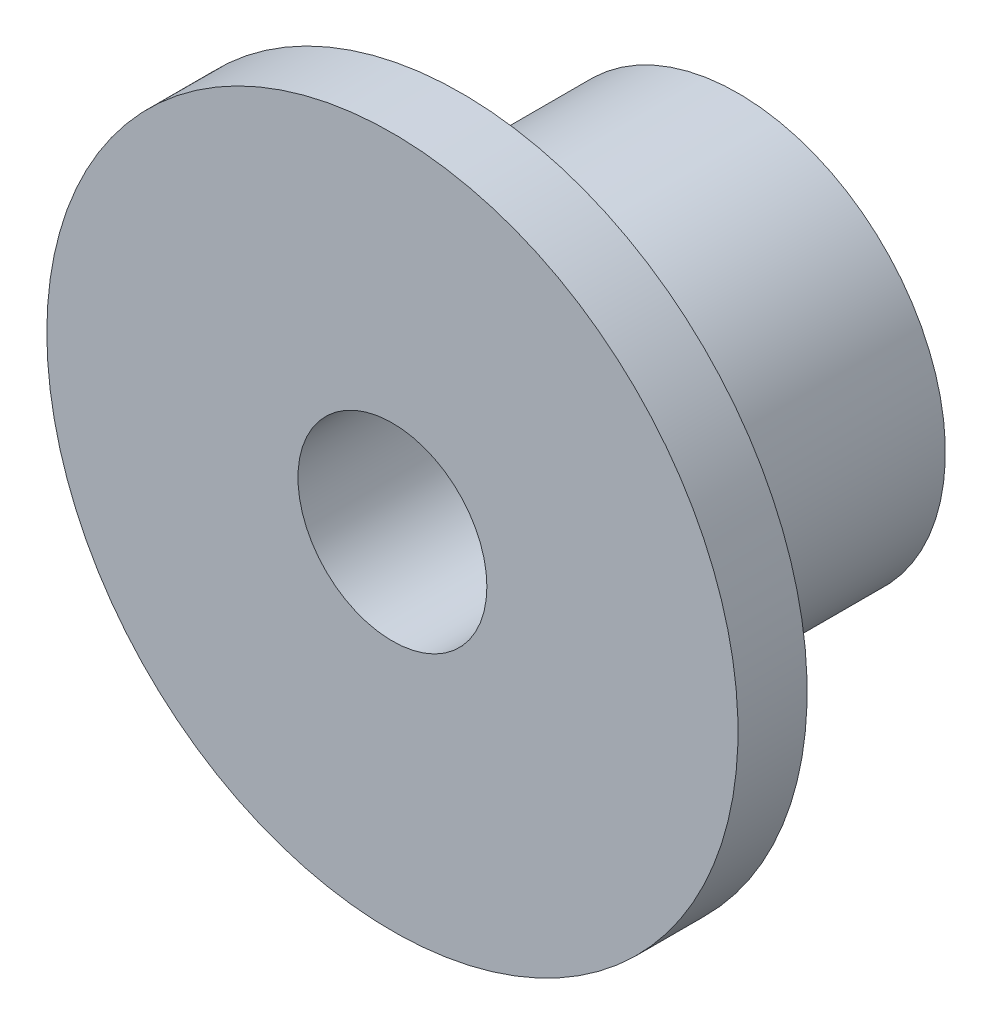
ISO-10303-21;
HEADER;
FILE_DESCRIPTION(('STEP AP214'),'2;1');
FILE_NAME('part.step','',(''),(''),'','','');
FILE_SCHEMA(('AUTOMOTIVE_DESIGN { 1 0 10303 214 1 1 1 1 }'));
ENDSEC;
DATA;
#1=APPLICATION_CONTEXT('core data for automotive mechanical design processes');
#2=APPLICATION_PROTOCOL_DEFINITION('international standard','automotive_design',2000,#1);
#3=PRODUCT_CONTEXT('',#1,'mechanical');
#4=PRODUCT('Part','Part','',(#3));
#5=PRODUCT_RELATED_PRODUCT_CATEGORY('part','',(#4));
#6=PRODUCT_DEFINITION_FORMATION('','',#4);
#7=PRODUCT_DEFINITION_CONTEXT('part definition',#1,'design');
#8=PRODUCT_DEFINITION('design','',#6,#7);
#9=PRODUCT_DEFINITION_SHAPE('','',#8);
#10=(LENGTH_UNIT() NAMED_UNIT(*) SI_UNIT(.MILLI.,.METRE.));
#11=(NAMED_UNIT(*) PLANE_ANGLE_UNIT() SI_UNIT($,.RADIAN.));
#12=(NAMED_UNIT(*) SI_UNIT($,.STERADIAN.) SOLID_ANGLE_UNIT());
#13=UNCERTAINTY_MEASURE_WITH_UNIT(LENGTH_MEASURE(1.E-05),#10,'distance_accuracy_value','');
#14=(GEOMETRIC_REPRESENTATION_CONTEXT(3) GLOBAL_UNCERTAINTY_ASSIGNED_CONTEXT((#13)) GLOBAL_UNIT_ASSIGNED_CONTEXT((#10,
#11,#12)) REPRESENTATION_CONTEXT('',''));
#15=CARTESIAN_POINT('',(0.,0.,0.));
#16=DIRECTION('',(0.,0.,1.));
#17=DIRECTION('',(1.,0.,0.));
#18=AXIS2_PLACEMENT_3D('',#15,#16,#17);
#19=CARTESIAN_POINT('',(-2.707236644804,4.523108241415,-3.9));
#20=DIRECTION('',(0.,0.,-1.));
#21=DIRECTION('',(1.,0.,0.));
#22=AXIS2_PLACEMENT_3D('',#19,#20,#21);
#23=PLANE('',#22);
#24=CARTESIAN_POINT('',(-1.771236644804,3.586463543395,-3.9));
#25=DIRECTION('',(0.,0.,1.));
#26=DIRECTION('',(1.,0.,0.));
#27=AXIS2_PLACEMENT_3D('',#24,#25,#26);
#28=CIRCLE('',#27,0.41);
#29=CARTESIAN_POINT('',(-1.361236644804,3.586463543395,-3.9));
#30=VERTEX_POINT('',#29);
#31=EDGE_CURVE('E34',#30,#30,#28,.T.);
#32=ORIENTED_EDGE('',*,*,#31,.T.);
#33=EDGE_LOOP('',(#32));
#34=FACE_BOUND('',#33,.T.);
#35=CARTESIAN_POINT('',(-1.771236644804,3.586463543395,-3.9));
#36=DIRECTION('',(0.,0.,-1.));
#37=DIRECTION('',(-1.,0.,0.));
#38=AXIS2_PLACEMENT_3D('',#35,#36,#37);
#39=CIRCLE('',#38,0.9000000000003);
#40=CARTESIAN_POINT('',(-2.6712366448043,3.586463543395,-3.9));
#41=VERTEX_POINT('',#40);
#42=EDGE_CURVE('E18',#41,#41,#39,.T.);
#43=ORIENTED_EDGE('',*,*,#42,.T.);
#44=EDGE_LOOP('',(#43));
#45=FACE_BOUND('',#44,.T.);
#46=ADVANCED_FACE('F14',(#34,#45),#23,.T.);
#47=CARTESIAN_POINT('',(-1.771236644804,3.586463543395,-2.7));
#48=DIRECTION('',(0.,0.,-1.));
#49=DIRECTION('',(-1.,0.,0.));
#50=AXIS2_PLACEMENT_3D('',#47,#48,#49);
#51=CYLINDRICAL_SURFACE('',#50,0.9000000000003);
#52=CARTESIAN_POINT('',(-1.771236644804,3.586463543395,-2.7));
#53=DIRECTION('',(0.,0.,-1.));
#54=DIRECTION('',(-1.,0.,0.));
#55=AXIS2_PLACEMENT_3D('',#52,#53,#54);
#56=CIRCLE('',#55,0.9000000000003);
#57=CARTESIAN_POINT('',(-2.6712366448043,3.586463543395,-2.7));
#58=VERTEX_POINT('',#57);
#59=EDGE_CURVE('E32',#58,#58,#56,.T.);
#60=ORIENTED_EDGE('',*,*,#59,.T.);
#61=EDGE_LOOP('',(#60));
#62=FACE_BOUND('',#61,.T.);
#63=ORIENTED_EDGE('',*,*,#42,.F.);
#64=EDGE_LOOP('',(#63));
#65=FACE_BOUND('',#64,.T.);
#66=ADVANCED_FACE('F42',(#62,#65),#51,.T.);
#67=CARTESIAN_POINT('',(-1.771236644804,3.586463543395,-3.9));
#68=DIRECTION('',(0.,0.,1.));
#69=DIRECTION('',(1.,0.,0.));
#70=AXIS2_PLACEMENT_3D('',#67,#68,#69);
#71=CYLINDRICAL_SURFACE('',#70,0.41);
#72=CARTESIAN_POINT('',(-1.771236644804,3.586463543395,-2.4));
#73=DIRECTION('',(0.,0.,1.));
#74=DIRECTION('',(1.,0.,0.));
#75=AXIS2_PLACEMENT_3D('',#72,#73,#74);
#76=CIRCLE('',#75,0.41);
#77=CARTESIAN_POINT('',(-1.361236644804,3.586463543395,-2.4));
#78=VERTEX_POINT('',#77);
#79=EDGE_CURVE('E27',#78,#78,#76,.T.);
#80=ORIENTED_EDGE('',*,*,#79,.T.);
#81=EDGE_LOOP('',(#80));
#82=FACE_BOUND('',#81,.T.);
#83=ORIENTED_EDGE('',*,*,#31,.F.);
#84=EDGE_LOOP('',(#83));
#85=FACE_BOUND('',#84,.T.);
#86=ADVANCED_FACE('F44',(#82,#85),#71,.F.);
#87=CARTESIAN_POINT('',(-3.331236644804,5.14714336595,-2.7));
#88=DIRECTION('',(0.,0.,-1.));
#89=DIRECTION('',(1.,0.,0.));
#90=AXIS2_PLACEMENT_3D('',#87,#88,#89);
#91=PLANE('',#90);
#92=ORIENTED_EDGE('',*,*,#59,.F.);
#93=EDGE_LOOP('',(#92));
#94=FACE_BOUND('',#93,.T.);
#95=CARTESIAN_POINT('',(-1.771236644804,3.586463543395,-2.7));
#96=DIRECTION('',(0.,0.,-1.));
#97=DIRECTION('',(-1.,0.,0.));
#98=AXIS2_PLACEMENT_3D('',#95,#96,#97);
#99=CIRCLE('',#98,1.5000000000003);
#100=CARTESIAN_POINT('',(-3.2712366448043,3.586463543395,-2.7));
#101=VERTEX_POINT('',#100);
#102=EDGE_CURVE('E22',#101,#101,#99,.T.);
#103=ORIENTED_EDGE('',*,*,#102,.T.);
#104=EDGE_LOOP('',(#103));
#105=FACE_BOUND('',#104,.T.);
#106=ADVANCED_FACE('F52',(#94,#105),#91,.T.);
#107=CARTESIAN_POINT('',(-3.331236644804,5.14714336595,-2.4));
#108=DIRECTION('',(0.,0.,-1.));
#109=DIRECTION('',(1.,0.,0.));
#110=AXIS2_PLACEMENT_3D('',#107,#108,#109);
#111=PLANE('',#110);
#112=ORIENTED_EDGE('',*,*,#79,.F.);
#113=EDGE_LOOP('',(#112));
#114=FACE_BOUND('',#113,.T.);
#115=CARTESIAN_POINT('',(-1.771236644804,3.586463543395,-2.4));
#116=DIRECTION('',(0.,0.,-1.));
#117=DIRECTION('',(-1.,0.,0.));
#118=AXIS2_PLACEMENT_3D('',#115,#116,#117);
#119=CIRCLE('',#118,1.5000000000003);
#120=CARTESIAN_POINT('',(-3.2712366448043,3.586463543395,-2.4));
#121=VERTEX_POINT('',#120);
#122=EDGE_CURVE('E10',#121,#121,#119,.F.);
#123=ORIENTED_EDGE('',*,*,#122,.T.);
#124=EDGE_LOOP('',(#123));
#125=FACE_BOUND('',#124,.T.);
#126=ADVANCED_FACE('F16',(#114,#125),#111,.F.);
#127=CARTESIAN_POINT('',(-1.771236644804,3.586463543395,-2.4));
#128=DIRECTION('',(0.,0.,-1.));
#129=DIRECTION('',(-1.,0.,0.));
#130=AXIS2_PLACEMENT_3D('',#127,#128,#129);
#131=CYLINDRICAL_SURFACE('',#130,1.5000000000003);
#132=ORIENTED_EDGE('',*,*,#122,.F.);
#133=EDGE_LOOP('',(#132));
#134=FACE_BOUND('',#133,.T.);
#135=ORIENTED_EDGE('',*,*,#102,.F.);
#136=EDGE_LOOP('',(#135));
#137=FACE_BOUND('',#136,.T.);
#138=ADVANCED_FACE('F56',(#134,#137),#131,.T.);
#139=CLOSED_SHELL('',(#46,#66,#86,#106,#126,#138));
#140=MANIFOLD_SOLID_BREP('B1',#139);
#141=ADVANCED_BREP_SHAPE_REPRESENTATION('',(#18,#140),#14);
#142=SHAPE_DEFINITION_REPRESENTATION(#9,#141);
ENDSEC;
END-ISO-10303-21;
